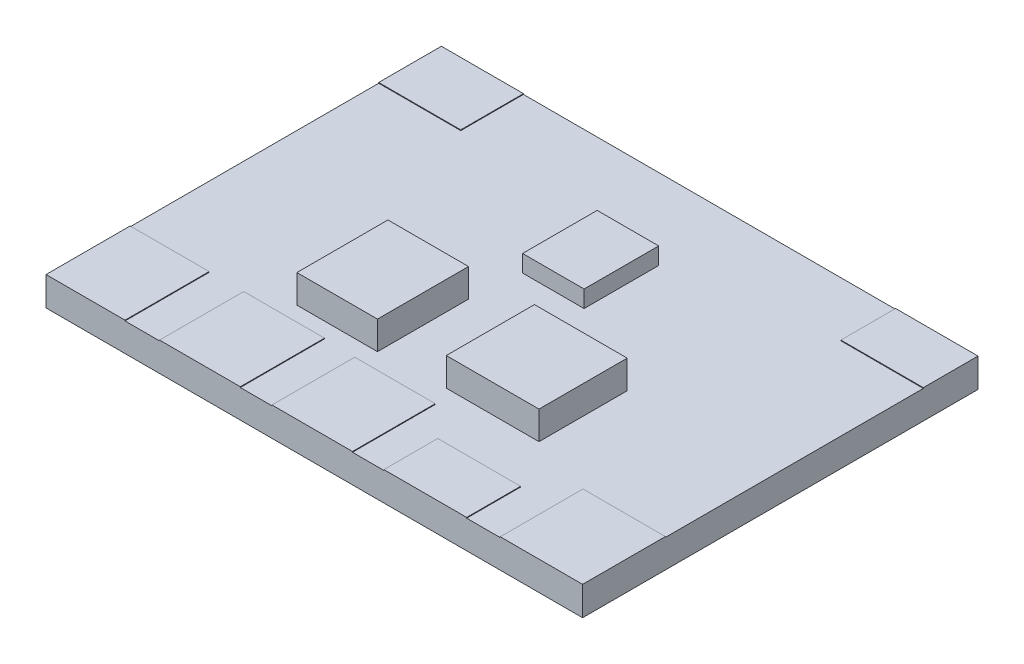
from build123d import *

# Parameters (mm, degrees)
SKETCH1_W           = 38
SKETCH1_H           = 28
BOSS_EXTRUDE1_DEPTH = 2
SKETCH2_W           = 5.708459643
SKETCH2_H           = 6.44696666
SKETCH2_W_2         = 6.566724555
SKETCH2_H_2         = 6.247370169
BOSS_EXTRUDE2_DEPTH = 2
SKETCH3_W           = 4.357517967
SKETCH3_H           = 5.282181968
BOSS_EXTRUDE3_DEPTH = 1.2
SKETCH4_W           = 5.811035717
SKETCH4_H           = 4.440237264
SKETCH4_W_2         = 5.83498463
SKETCH4_H_2         = 3.871913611
SKETCH4_H_3         = 5.861651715
SKETCH4_W_3         = 5.863376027
SKETCH4_H_4         = 3.815913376
SKETCH4_W_4         = 5.702294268
SKETCH4_W_5         = 5.594753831
SKETCH4_H_5         = 5.95830077
SKETCH4_W_6         = 5.717267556
BOSS_EXTRUDE4_DEPTH = 0.05


with BuildPart() as part:
    # Sketch1 → Boss-Extrude1 (new body)
    with BuildSketch(Plane(origin=(0, 0, 0), x_dir=(1, 0, 0), z_dir=(0, 1, 0))):
        Rectangle(SKETCH1_W, SKETCH1_H)
    extrude(amount=BOSS_EXTRUDE1_DEPTH)

    # Sketch2 → Boss-Extrude2 (add)
    with BuildSketch(Plane(origin=(0, 2, 0), x_dir=(1, 0, 0), z_dir=(0, 1, 0))):
        with Locations((-5.434686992, -3.721621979)):
            Rectangle(SKETCH2_W, SKETCH2_H)
        with Locations((5.373462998, -3.621823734)):
            Rectangle(SKETCH2_W_2, SKETCH2_H_2)
    extrude(amount=BOSS_EXTRUDE2_DEPTH)

    # Sketch3 → Boss-Extrude3 (add)
    with BuildSketch(Plane(origin=(0, 2, 0), x_dir=(1, 0, 0), z_dir=(0, 1, 0))):
        with Locations((-0.088658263, 5.656792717)):
            Rectangle(SKETCH3_W, SKETCH3_H)
    extrude(amount=BOSS_EXTRUDE3_DEPTH)

    # Sketch4 → Boss-Extrude4 (add)
    with BuildSketch(Plane(origin=(0, 2, 0), x_dir=(1, 0, 0), z_dir=(0, 1, 0))):
        with Locations((-16.094482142, 11.779881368)):
            Rectangle(SKETCH4_W, SKETCH4_H)
        with Locations((16.082507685, 12.064043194)):
            Rectangle(SKETCH4_W_2, SKETCH4_H_2)
        with Locations((16.082507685, -11.069174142)):
            Rectangle(SKETCH4_W_2, SKETCH4_H_3)
        with Locations((7.857546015, -12.092043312)):
            Rectangle(SKETCH4_W_3, SKETCH4_H_4)
        with Locations((-0.148217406, -11.069174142)):
            Rectangle(SKETCH4_W_4, SKETCH4_H_3)
        with Locations((-16.202623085, -11.020849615)):
            Rectangle(SKETCH4_W_5, SKETCH4_H_5)
        with Locations((-8.098169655, -11.020849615)):
            Rectangle(SKETCH4_W_6, SKETCH4_H_5)
    extrude(amount=BOSS_EXTRUDE4_DEPTH)


solid = part.part
